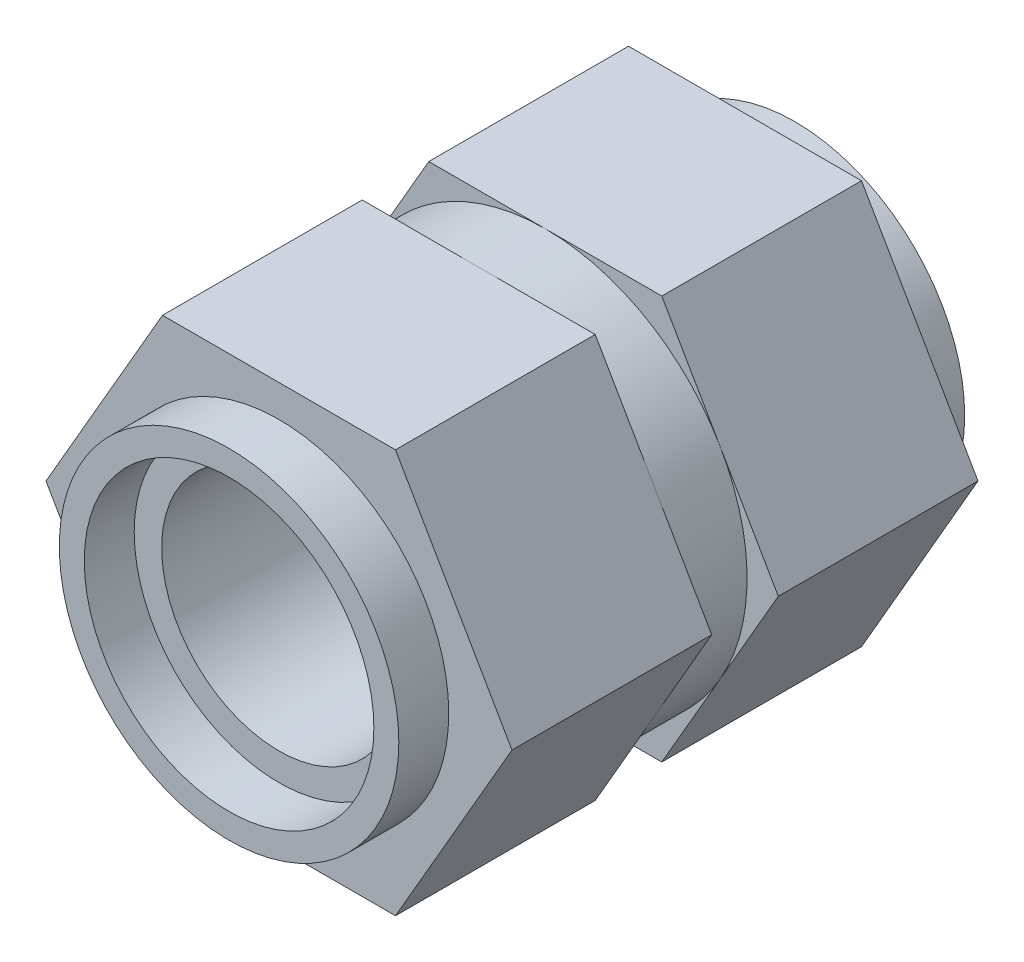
from build123d import *

# Parameters (mm, degrees)
BOSS_EXTRUDE1_DEPTH = 6
SKETCH2_R           = 6.062178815
BOSS_EXTRUDE2_DEPTH = 2
BOSS_EXTRUDE3_DEPTH = 6
SKETCH4_R           = 3.525
CUT_EXTRUDE1_DEPTH  = 11.5
SKETCH5_R           = 5.1
SKETCH5_R_2         = 4.35
BOSS_EXTRUDE4_DEPTH = 1.5
BOSS_EXTRUDE5_START = 1.5
SKETCH6_R           = 5.1
SKETCH6_R_2         = 4.35
BOSS_EXTRUDE5_DEPTH = 1.5
SKETCH7_R           = 1.5
CUT_EXTRUDE2_DEPTH  = 2.5


with BuildPart() as part:
    # Sketch1 → Boss-Extrude1 (new body)
    with BuildSketch(Plane.XY):
        Polygon((7, 0), (3.5, 6.062177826), (-3.5, 6.062177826), (-7, 0), (-3.5, -6.062177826), (3.5, -6.062177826), align=None)
    extrude(amount=BOSS_EXTRUDE1_DEPTH)

    # Sketch2 → Boss-Extrude2 (add)
    with BuildSketch(Plane.XY.offset(6)):
        with Locations(Location((0, 0, 0), (0, 0, 150))):
            Circle(SKETCH2_R)
    extrude(amount=BOSS_EXTRUDE2_DEPTH)

    # Sketch3 → Boss-Extrude3 (add)
    with BuildSketch(Plane.XY.offset(8)):
        Polygon((7, 0), (3.5, 6.062177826), (-3.5, 6.062177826), (-7, 0), (-3.5, -6.062177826), (3.5, -6.062177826), align=None)
    extrude(amount=BOSS_EXTRUDE3_DEPTH)

    # Sketch4 → Cut-Extrude1 (cut)
    with BuildSketch(Plane.XY.offset(14)):
        Circle(SKETCH4_R)
    extrude(amount=-CUT_EXTRUDE1_DEPTH, mode=Mode.SUBTRACT)

    # Sketch5 → Boss-Extrude4 (add)
    with BuildSketch(Plane(origin=(0, 0, 0), x_dir=(-1, 0, 0), z_dir=(0, 0, -1))):
        with Locations(Location((0, 0, 0), (0, 0, 180))):
            Circle(SKETCH5_R)
        Circle(SKETCH5_R_2, mode=Mode.SUBTRACT)
    extrude(amount=BOSS_EXTRUDE4_DEPTH)

    # Sketch6 → Boss-Extrude5 (add)
    with BuildSketch(Plane.XY.offset(14).offset(BOSS_EXTRUDE5_START)):
        Circle(SKETCH6_R)
        with Locations(Location((0, 0, 0), (0, 0, 180))):
            Circle(SKETCH6_R_2, mode=Mode.SUBTRACT)
    extrude(amount=-BOSS_EXTRUDE5_DEPTH)

    # Sketch7 → Cut-Extrude2 (cut)
    with BuildSketch(Plane(origin=(0, 0, 0), x_dir=(-1, 0, 0), z_dir=(0, 0, -1))):
        Circle(SKETCH7_R)
    extrude(amount=-CUT_EXTRUDE2_DEPTH, mode=Mode.SUBTRACT)


solid = part.part
